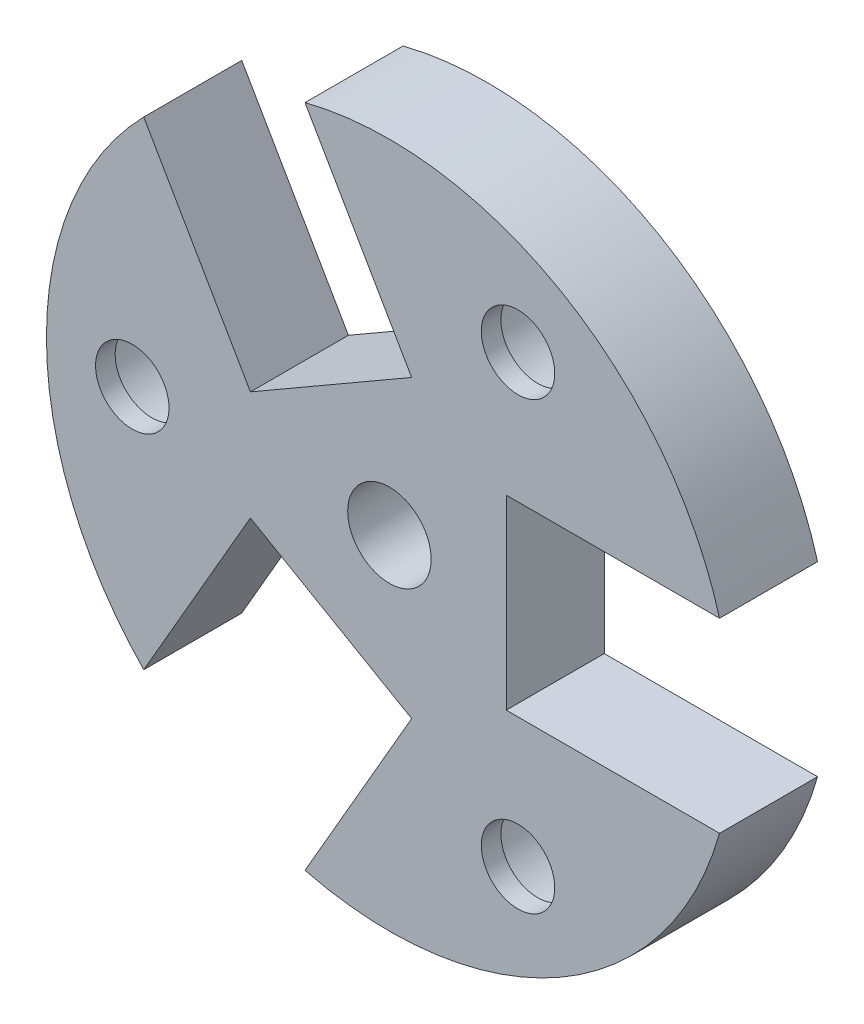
from build123d import *

# Parameters (mm, degrees)
SKETCH2_R               = 22.225
EXTRUDE1_DEPTH          = 6.35
SKETCH6_W               = 25.4
SKETCH6_H               = 12.065
CUT_EXTRUDE2_DEPTH      = 33.065928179
CIRPATTERN1_COUNT       = 3
SKETCH8_R               = 2.38125
CUT_EXTRUDE3_DEPTH      = 33.065928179
SKETCH10_R              = 3.96875
CUT_EXTRUDE4_DEPTH      = 5.08
CIRPATTERN2_COUNT       = 3
F_1_4_28_TAPPED_HOLE1_D = 5.4102


with BuildPart() as part:
    # Sketch2 → Extrude1 (new body)
    with BuildSketch(Plane.XY):
        Circle(SKETCH2_R)
    extrude(amount=-EXTRUDE1_DEPTH)

    # Sketch6 → Cut-Extrude2 (cut, through all)
    with BuildSketch(Plane.XY):
        with Locations((20.2692, 0)):
            Rectangle(SKETCH6_W, SKETCH6_H)
    cut_extrude2 = extrude(amount=-CUT_EXTRUDE2_DEPTH, mode=Mode.SUBTRACT)

    # CirPattern1: Cut-Extrude2 ×3 about axis
    cirpattern1_axis = Axis((0, 0, 0), (0, 0, 1))
    for i in range(1, CIRPATTERN1_COUNT):
        add(cut_extrude2.rotate(cirpattern1_axis, i * 360 / CIRPATTERN1_COUNT), mode=Mode.SUBTRACT)

    # Sketch8 → Cut-Extrude3 (cut, through all)
    with BuildSketch(Plane(origin=(0, 0, -6.35), x_dir=(-1, 0, 0), z_dir=(0, 0, -1))):
        with Locations((16.6624, 0)):
            Circle(SKETCH8_R)
    cut_extrude3 = extrude(amount=-CUT_EXTRUDE3_DEPTH, mode=Mode.SUBTRACT)

    # Sketch10 → Cut-Extrude4 (cut)
    with BuildSketch(Plane(origin=(0, 0, -6.35), x_dir=(-1, 0, 0), z_dir=(0, 0, -1))):
        with Locations((16.6624, 0)):
            Circle(SKETCH10_R)
    cut_extrude4 = extrude(amount=-CUT_EXTRUDE4_DEPTH, mode=Mode.SUBTRACT)

    # CirPattern2: Cut-Extrude3, Cut-Extrude4 ×3 about axis
    cirpattern2_axis = Axis((0, 0, 0), (0, 0, 1))
    add([cut_extrude3.rotate(cirpattern2_axis, i * 360 / CIRPATTERN2_COUNT) for i in range(1, CIRPATTERN2_COUNT)], mode=Mode.SUBTRACT)
    add([cut_extrude4.rotate(cirpattern2_axis, i * 360 / CIRPATTERN2_COUNT) for i in range(1, CIRPATTERN2_COUNT)], mode=Mode.SUBTRACT)

    # 1_4-28 Tapped Hole1 (through all)
    with Locations(Plane(origin=(0, 0, -6.35), x_dir=(-1, 0, 0), z_dir=(0, 0, -1))):
        with Locations((0, 0)):
            Hole(F_1_4_28_TAPPED_HOLE1_D / 2)


solid = part.part
